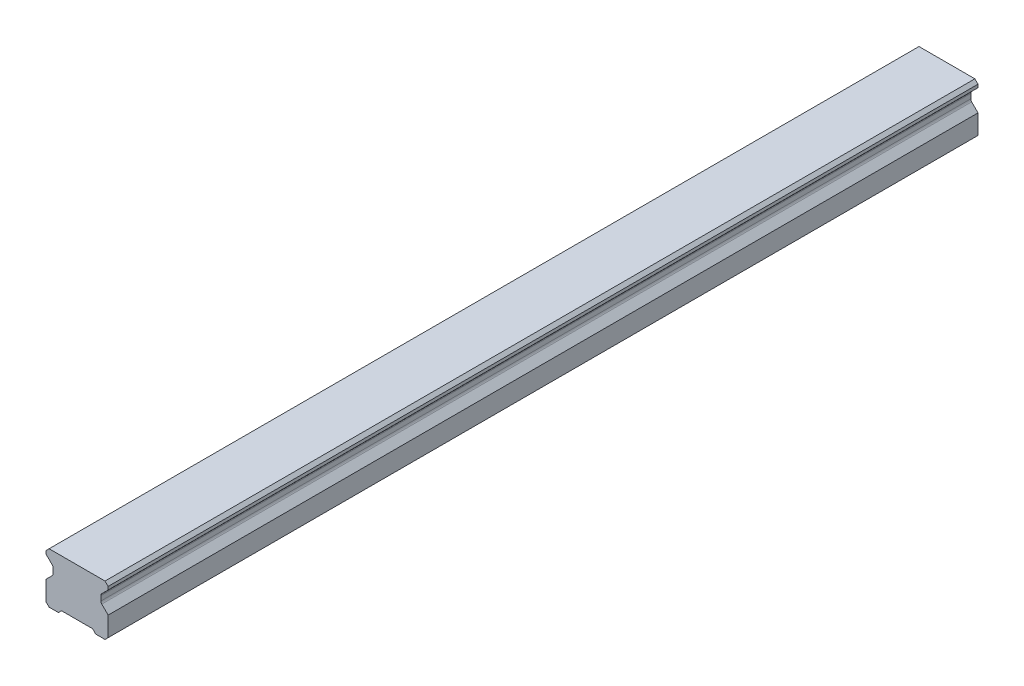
from build123d import *

# Parameters (mm, degrees)
SKETCH1_W           = 20
SKETCH1_H           = 16.3
BOSS_EXTRUDE1_DEPTH = 140
CUT_EXTRUDE1_DEPTH  = 281.652258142
CHAMFER1_SIZE       = 1
FILLET1_R           = 1
CUT_EXTRUDE2_DEPTH  = 281.652258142
SKETCH5_R           = 3
SKETCH5_R_2         = 2.5
CUT_EXTRUDE5_DEPTH  = 10
SKETCH5_2_R         = 2.5
CUT_EXTRUDE6_DEPTH  = 13
LPATTERN2_COUNT     = 5
LPATTERN2_PITCH     = 60


with BuildPart() as part:
    # Sketch1 → Boss-Extrude1 (new, symmetric)
    with BuildSketch(Plane.XY):
        with Locations((0, 8.15)):
            Rectangle(SKETCH1_W, SKETCH1_H)
    extrude(amount=BOSS_EXTRUDE1_DEPTH, both=True)

    # Sketch2 → Cut-Extrude1 (cut, through all)
    with BuildSketch(Plane.XY.offset(140)):
        Polygon((-10, 14.3), (-10, 7.3), (-7.666666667, 9.633333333), (-7.666666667, 11.966666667), align=None)
        Polygon((7.666666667, 11.966666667), (10, 14.3), (10, 7.3), (7.666666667, 9.633333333), align=None)
    extrude(amount=-CUT_EXTRUDE1_DEPTH, mode=Mode.SUBTRACT)

    # Chamfer1
    chamfer1_edges = [part.edges().sort_by_distance(p)[0] for p in [
        (-10, 16.3, 0),
        (10, 16.3, 0),
        (10, 0, 0),
        (-10, 0, 0),
    ]]
    chamfer(chamfer1_edges, length=CHAMFER1_SIZE)

    # Fillet1
    fillet1_edges = [part.edges().sort_by_distance(p)[0] for p in [
        (-7.666666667, 11.966666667, 0),
        (-7.666666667, 9.633333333, 0),
        (7.666666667, 9.633333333, 0),
        (7.666666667, 11.966666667, 0),
    ]]
    fillet(fillet1_edges, radius=FILLET1_R)

    # Sketch3 → Cut-Extrude2 (cut, through all)
    with BuildSketch(Plane.XY.offset(140)):
        Polygon((-6, 0), (-5, 1), (5, 1), (6, 0), align=None)
    extrude(amount=-CUT_EXTRUDE2_DEPTH, mode=Mode.SUBTRACT)

    # Sketch5 → Cut-Extrude5 (cut)
    with BuildSketch(Plane.XZ.offset(-1)):
        with Locations(Location((0, 120, 0), (0, 0, 270))):
            Circle(SKETCH5_R)
        with Locations(Location((0, 120, 0), (0, 0, 270))):
            Circle(SKETCH5_R_2, mode=Mode.SUBTRACT)
    cut_extrude5 = extrude(amount=-CUT_EXTRUDE5_DEPTH, mode=Mode.SUBTRACT)

    # Sketch5_2 → Cut-Extrude6 (cut)
    with BuildSketch(Plane.XZ.offset(-1)):
        with Locations(Location((0, 120, 0), (0, 0, 270))):
            Circle(SKETCH5_2_R)
    cut_extrude6 = extrude(amount=-CUT_EXTRUDE6_DEPTH, mode=Mode.SUBTRACT)

    # Cut-Extrude7 cone 1 section (on through the dimple's axis) → Cut-Extrude7 (revolve, cut)
    with BuildSketch(Plane(origin=(0, 14, 120), x_dir=(0, 0, -1), z_dir=(1, 0, 0))):
        Polygon((0, 0), (2.5, 0), (0, 1.443375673), align=None)
    cut_extrude7 = revolve(axis=Axis((0, 14, 120), (0, 1, 0)), mode=Mode.SUBTRACT)

    # LPattern2: Cut-Extrude5, Cut-Extrude6, Cut-Extrude7 ×5
    with Locations(*[(0, 0, -i * LPATTERN2_PITCH) for i in range(1, LPATTERN2_COUNT)]):
        add(cut_extrude5, mode=Mode.SUBTRACT)
        add(cut_extrude6, mode=Mode.SUBTRACT)
        add(cut_extrude7, mode=Mode.SUBTRACT)


solid = part.part
